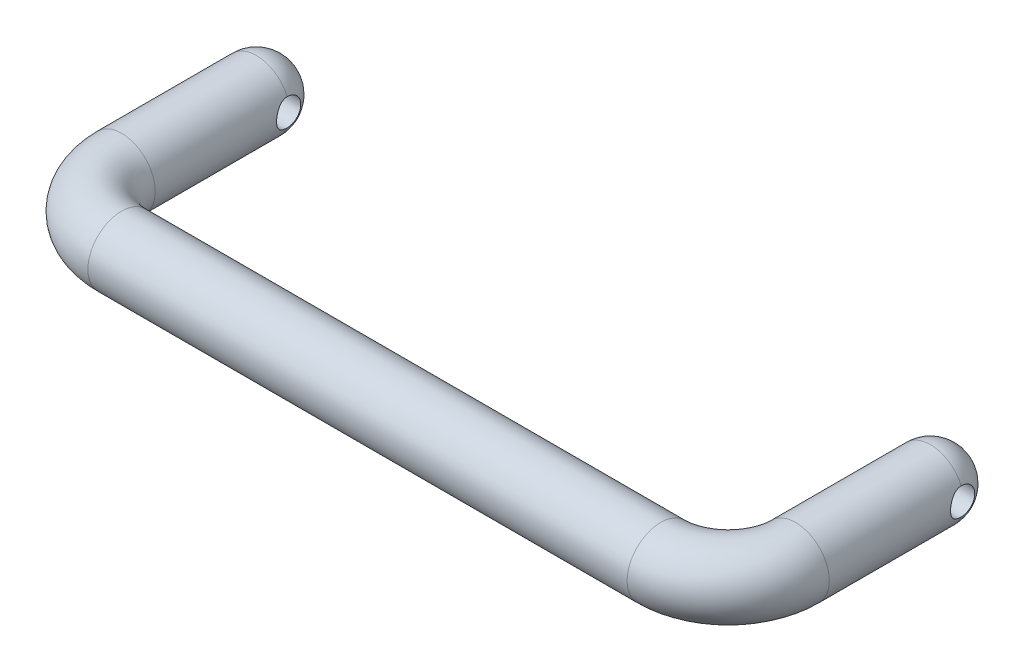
ISO-10303-21;
HEADER;
FILE_DESCRIPTION(('STEP AP214'),'2;1');
FILE_NAME('part.step','',(''),(''),'','','');
FILE_SCHEMA(('AUTOMOTIVE_DESIGN { 1 0 10303 214 1 1 1 1 }'));
ENDSEC;
DATA;
#1=APPLICATION_CONTEXT('core data for automotive mechanical design processes');
#2=APPLICATION_PROTOCOL_DEFINITION('international standard','automotive_design',2000,#1);
#3=PRODUCT_CONTEXT('',#1,'mechanical');
#4=PRODUCT('Part','Part','',(#3));
#5=PRODUCT_RELATED_PRODUCT_CATEGORY('part','',(#4));
#6=PRODUCT_DEFINITION_FORMATION('','',#4);
#7=PRODUCT_DEFINITION_CONTEXT('part definition',#1,'design');
#8=PRODUCT_DEFINITION('design','',#6,#7);
#9=PRODUCT_DEFINITION_SHAPE('','',#8);
#10=(LENGTH_UNIT() NAMED_UNIT(*) SI_UNIT(.MILLI.,.METRE.));
#11=(NAMED_UNIT(*) PLANE_ANGLE_UNIT() SI_UNIT($,.RADIAN.));
#12=(NAMED_UNIT(*) SI_UNIT($,.STERADIAN.) SOLID_ANGLE_UNIT());
#13=UNCERTAINTY_MEASURE_WITH_UNIT(LENGTH_MEASURE(1.E-05),#10,'distance_accuracy_value','');
#14=(GEOMETRIC_REPRESENTATION_CONTEXT(3) GLOBAL_UNCERTAINTY_ASSIGNED_CONTEXT((#13)) GLOBAL_UNIT_ASSIGNED_CONTEXT((#10,
#11,#12)) REPRESENTATION_CONTEXT('',''));
#15=CARTESIAN_POINT('',(0.,0.,0.));
#16=DIRECTION('',(0.,0.,1.));
#17=DIRECTION('',(1.,0.,0.));
#18=AXIS2_PLACEMENT_3D('',#15,#16,#17);
#19=CARTESIAN_POINT('',(100.,0.,20.));
#20=DIRECTION('',(0.,0.,-1.));
#21=DIRECTION('',(0.,1.,0.));
#22=AXIS2_PLACEMENT_3D('',#19,#20,#21);
#23=CYLINDRICAL_SURFACE('',#22,5.);
#24=CARTESIAN_POINT('',(104.582575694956,2.,0.));
#25=CARTESIAN_POINT('',(104.582564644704,2.00000798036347,0.0538058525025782));
#26=CARTESIAN_POINT('',(104.583523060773,1.99782891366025,0.107605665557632));
#27=CARTESIAN_POINT('',(104.587296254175,1.98915905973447,0.214771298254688));
#28=CARTESIAN_POINT('',(104.590110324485,1.98266991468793,0.268137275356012));
#29=CARTESIAN_POINT('',(104.597497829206,1.9654760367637,0.373846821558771));
#30=CARTESIAN_POINT('',(104.602064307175,1.95478796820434,0.426193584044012));
#31=CARTESIAN_POINT('',(104.612800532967,1.92931630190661,0.529700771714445));
#32=CARTESIAN_POINT('',(104.618970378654,1.91453245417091,0.580861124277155));
#33=CARTESIAN_POINT('',(104.639592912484,1.86426971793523,0.731935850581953));
#34=CARTESIAN_POINT('',(104.656174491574,1.82284489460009,0.829654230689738));
#35=CARTESIAN_POINT('',(104.693123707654,1.72548191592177,1.01679558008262));
#36=CARTESIAN_POINT('',(104.71349493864,1.66952996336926,1.10621055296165));
#37=CARTESIAN_POINT('',(104.757009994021,1.54131835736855,1.27926239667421));
#38=CARTESIAN_POINT('',(104.780242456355,1.46836913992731,1.36236721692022));
#39=CARTESIAN_POINT('',(104.826127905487,1.3096964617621,1.51554027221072));
#40=CARTESIAN_POINT('',(104.848780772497,1.22397038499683,1.58560583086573));
#41=CARTESIAN_POINT('',(104.892034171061,1.0380059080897,1.71340639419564));
#42=CARTESIAN_POINT('',(104.912518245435,0.937327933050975,1.77054480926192));
#43=CARTESIAN_POINT('',(104.94803944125,0.726824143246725,1.86684407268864));
#44=CARTESIAN_POINT('',(104.963078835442,0.617002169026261,1.90601242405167));
#45=CARTESIAN_POINT('',(104.985383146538,0.396967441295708,1.96334120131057));
#46=CARTESIAN_POINT('',(104.992989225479,0.287031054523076,1.98242695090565));
#47=CARTESIAN_POINT('',(105.000803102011,0.0652684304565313,2.00202847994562));
#48=CARTESIAN_POINT('',(105.00101352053,-0.0465571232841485,2.00255083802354));
#49=CARTESIAN_POINT('',(104.994219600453,-0.262233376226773,1.98551716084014));
#50=CARTESIAN_POINT('',(104.987619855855,-0.366179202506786,1.968974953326));
#51=CARTESIAN_POINT('',(104.968492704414,-0.569674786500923,1.92000657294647));
#52=CARTESIAN_POINT('',(104.955964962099,-0.669224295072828,1.8875795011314));
#53=CARTESIAN_POINT('',(104.925968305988,-0.862897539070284,1.80736370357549));
#54=CARTESIAN_POINT('',(104.908427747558,-0.95691685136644,1.75935075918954));
#55=CARTESIAN_POINT('',(104.87014602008,-1.13580746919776,1.64953541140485));
#56=CARTESIAN_POINT('',(104.849403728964,-1.22067554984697,1.58772817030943));
#57=CARTESIAN_POINT('',(104.805217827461,-1.38476339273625,1.4473558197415));
#58=CARTESIAN_POINT('',(104.781686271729,-1.46324770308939,1.36795752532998));
#59=CARTESIAN_POINT('',(104.735619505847,-1.60609926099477,1.19701990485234));
#60=CARTESIAN_POINT('',(104.713084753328,-1.67046007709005,1.10547507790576));
#61=CARTESIAN_POINT('',(104.67095688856,-1.78493657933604,0.909529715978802));
#62=CARTESIAN_POINT('',(104.651467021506,-1.83458932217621,0.804835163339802));
#63=CARTESIAN_POINT('',(104.618861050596,-1.91521298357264,0.587638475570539));
#64=CARTESIAN_POINT('',(104.605733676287,-1.94621696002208,0.475150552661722));
#65=CARTESIAN_POINT('',(104.592083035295,-1.9781058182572,0.30125636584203));
#66=CARTESIAN_POINT('',(104.588534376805,-1.98630505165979,0.241342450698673));
#67=CARTESIAN_POINT('',(104.583775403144,-1.99725282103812,0.120964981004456));
#68=CARTESIAN_POINT('',(104.582563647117,-2.00000471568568,0.0605017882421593));
#69=CARTESIAN_POINT('',(104.582575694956,-2.,0.));
#70=B_SPLINE_CURVE_WITH_KNOTS('',3,(#24,#25,#26,#27,#28,#29,#30,#31,#32,#33,#34,#35,#36,#37,#38,
#39,#40,#41,#42,#43,#44,#45,#46,#47,#48,#49,#50,#51,#52,#53,#54,#55,#56,#57,#58,#59,#60,#61,#62,
#63,#64,#65,#66,#67,#68,#69),.UNSPECIFIED.,.F.,.F.,(4,2,2,2,2,2,2,2,2,2,2,2,2,2,2,2,2,2,2,2,2,2,
4),(0.,0.161354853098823,0.322648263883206,0.483307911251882,0.643977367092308,
0.964683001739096,1.28569434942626,1.62318047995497,1.9607358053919,2.31162858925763,
2.66237473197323,2.9961387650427,3.32978451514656,3.64468915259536,3.95961161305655,
4.27928176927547,4.5990642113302,4.93981874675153,5.28072813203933,5.63144241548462,
5.98153315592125,6.16300192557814,6.34435877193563),.UNSPECIFIED.);
#71=CARTESIAN_POINT('',(104.582575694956,2.,0.));
#72=VERTEX_POINT('',#71);
#73=CARTESIAN_POINT('',(104.582575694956,-2.,0.));
#74=VERTEX_POINT('',#73);
#75=EDGE_CURVE('E66',#72,#74,#70,.T.);
#76=ORIENTED_EDGE('',*,*,#75,.F.);
#77=CARTESIAN_POINT('',(100.,0.,0.));
#78=DIRECTION('',(0.,0.,-1.));
#79=DIRECTION('',(0.,-1.,0.));
#80=AXIS2_PLACEMENT_3D('',#77,#78,#79);
#81=CIRCLE('',#80,5.);
#82=CARTESIAN_POINT('',(95.4174243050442,2.00000000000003,0.));
#83=VERTEX_POINT('',#82);
#84=EDGE_CURVE('E60',#83,#72,#81,.T.);
#85=ORIENTED_EDGE('',*,*,#84,.F.);
#86=CARTESIAN_POINT('',(95.4174243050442,-2.,0.));
#87=CARTESIAN_POINT('',(95.4174353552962,-2.00000798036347,0.0538058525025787));
#88=CARTESIAN_POINT('',(95.4164769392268,-1.99782891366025,0.107605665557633));
#89=CARTESIAN_POINT('',(95.4127037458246,-1.98915905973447,0.214771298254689));
#90=CARTESIAN_POINT('',(95.4098896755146,-1.98266991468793,0.268137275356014));
#91=CARTESIAN_POINT('',(95.4025021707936,-1.9654760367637,0.373846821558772));
#92=CARTESIAN_POINT('',(95.3979356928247,-1.95478796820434,0.426193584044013));
#93=CARTESIAN_POINT('',(95.3871994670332,-1.92931630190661,0.529700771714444));
#94=CARTESIAN_POINT('',(95.381029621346,-1.91453245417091,0.580861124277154));
#95=CARTESIAN_POINT('',(95.3604070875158,-1.86426971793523,0.731935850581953));
#96=CARTESIAN_POINT('',(95.3438255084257,-1.82284489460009,0.829654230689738));
#97=CARTESIAN_POINT('',(95.3068762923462,-1.72548191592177,1.01679558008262));
#98=CARTESIAN_POINT('',(95.2865050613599,-1.66952996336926,1.10621055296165));
#99=CARTESIAN_POINT('',(95.2429900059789,-1.54131835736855,1.27926239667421));
#100=CARTESIAN_POINT('',(95.2197575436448,-1.46836913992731,1.36236721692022));
#101=CARTESIAN_POINT('',(95.1738720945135,-1.3096964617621,1.51554027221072));
#102=CARTESIAN_POINT('',(95.1512192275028,-1.22397038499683,1.58560583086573));
#103=CARTESIAN_POINT('',(95.1079658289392,-1.0380059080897,1.71340639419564));
#104=CARTESIAN_POINT('',(95.0874817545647,-0.937327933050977,1.77054480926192));
#105=CARTESIAN_POINT('',(95.05196055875,-0.726824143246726,1.86684407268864));
#106=CARTESIAN_POINT('',(95.0369211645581,-0.617002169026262,1.90601242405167));
#107=CARTESIAN_POINT('',(95.0146168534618,-0.396967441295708,1.96334120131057));
#108=CARTESIAN_POINT('',(95.0070107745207,-0.287031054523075,1.98242695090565));
#109=CARTESIAN_POINT('',(94.9991968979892,-0.065268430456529,2.00202847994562));
#110=CARTESIAN_POINT('',(94.9989864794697,0.046557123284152,2.00255083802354));
#111=CARTESIAN_POINT('',(95.0057803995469,0.262233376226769,1.98551716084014));
#112=CARTESIAN_POINT('',(95.0123801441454,0.366179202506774,1.968974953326));
#113=CARTESIAN_POINT('',(95.0315072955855,0.569674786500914,1.92000657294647));
#114=CARTESIAN_POINT('',(95.0440350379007,0.66922429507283,1.8875795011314));
#115=CARTESIAN_POINT('',(95.0740316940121,0.862897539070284,1.8073637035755));
#116=CARTESIAN_POINT('',(95.0915722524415,0.956916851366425,1.75935075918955));
#117=CARTESIAN_POINT('',(95.1298539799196,1.13580746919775,1.64953541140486));
#118=CARTESIAN_POINT('',(95.1505962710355,1.22067554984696,1.58772817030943));
#119=CARTESIAN_POINT('',(95.1947821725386,1.38476339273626,1.44735581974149));
#120=CARTESIAN_POINT('',(95.2183137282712,1.46324770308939,1.36795752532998));
#121=CARTESIAN_POINT('',(95.2643804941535,1.60609926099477,1.19701990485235));
#122=CARTESIAN_POINT('',(95.2869152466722,1.67046007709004,1.10547507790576));
#123=CARTESIAN_POINT('',(95.3290431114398,1.78493657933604,0.909529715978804));
#124=CARTESIAN_POINT('',(95.3485329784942,1.83458932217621,0.804835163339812));
#125=CARTESIAN_POINT('',(95.3811389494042,1.91521298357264,0.587638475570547));
#126=CARTESIAN_POINT('',(95.3942663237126,1.94621696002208,0.475150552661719));
#127=CARTESIAN_POINT('',(95.407916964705,1.9781058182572,0.301256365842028));
#128=CARTESIAN_POINT('',(95.4114656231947,1.98630505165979,0.241342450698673));
#129=CARTESIAN_POINT('',(95.4162245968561,1.99725282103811,0.12096498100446));
#130=CARTESIAN_POINT('',(95.4174363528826,2.00000471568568,0.060501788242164));
#131=CARTESIAN_POINT('',(95.4174243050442,2.,0.));
#132=B_SPLINE_CURVE_WITH_KNOTS('',3,(#86,#87,#88,#89,#90,#91,#92,#93,#94,#95,#96,#97,#98,#99,
#100,#101,#102,#103,#104,#105,#106,#107,#108,#109,#110,#111,#112,#113,#114,#115,#116,#117,#118,
#119,#120,#121,#122,#123,#124,#125,#126,#127,#128,#129,#130,#131),.UNSPECIFIED.,.F.,.F.,(4,2,2,
2,2,2,2,2,2,2,2,2,2,2,2,2,2,2,2,2,2,2,4),(0.,0.161354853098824,0.322648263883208,
0.483307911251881,0.643977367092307,0.964683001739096,1.28569434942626,1.62318047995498,
1.9607358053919,2.31162858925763,2.66237473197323,2.9961387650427,3.32978451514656,
3.64468915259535,3.95961161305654,4.27928176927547,4.59906421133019,4.93981874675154,
5.28072813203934,5.63144241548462,5.98153315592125,6.16300192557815,6.34435877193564),.UNSPECIFIED.);
#133=CARTESIAN_POINT('',(95.4174243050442,-2.00000000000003,0.));
#134=VERTEX_POINT('',#133);
#135=EDGE_CURVE('E55',#134,#83,#132,.T.);
#136=ORIENTED_EDGE('',*,*,#135,.F.);
#137=EDGE_CURVE('E65',#74,#134,#81,.T.);
#138=ORIENTED_EDGE('',*,*,#137,.F.);
#139=EDGE_LOOP('',(#76,#85,#136,#138));
#140=FACE_BOUND('',#139,.T.);
#141=CARTESIAN_POINT('',(100.,0.,20.));
#142=DIRECTION('',(0.,0.,-1.));
#143=DIRECTION('',(0.,-1.,0.));
#144=AXIS2_PLACEMENT_3D('',#141,#142,#143);
#145=CIRCLE('',#144,5.);
#146=CARTESIAN_POINT('',(105.,0.,20.));
#147=VERTEX_POINT('',#146);
#148=EDGE_CURVE('E70',#147,#147,#145,.T.);
#149=ORIENTED_EDGE('',*,*,#148,.T.);
#150=EDGE_LOOP('',(#149));
#151=FACE_BOUND('',#150,.T.);
#152=ADVANCED_FACE('F14',(#140,#151),#23,.T.);
#153=CARTESIAN_POINT('',(90.,0.,20.));
#154=DIRECTION('',(0.,1.,0.));
#155=DIRECTION('',(-1.,0.,0.));
#156=AXIS2_PLACEMENT_3D('',#153,#154,#155);
#157=TOROIDAL_SURFACE('',#156,10.,5.);
#158=CARTESIAN_POINT('',(90.,0.,30.));
#159=DIRECTION('',(1.,0.,0.));
#160=DIRECTION('',(0.,-1.,0.));
#161=AXIS2_PLACEMENT_3D('',#158,#159,#160);
#162=CIRCLE('',#161,5.);
#163=CARTESIAN_POINT('',(90.,0.,35.));
#164=VERTEX_POINT('',#163);
#165=EDGE_CURVE('E73',#164,#164,#162,.T.);
#166=CARTESIAN_POINT('',(90.,0.,20.));
#167=DIRECTION('',(0.,1.,0.));
#168=DIRECTION('',(-1.,0.,0.));
#169=AXIS2_PLACEMENT_3D('',#166,#167,#168);
#170=CIRCLE('',#169,15.);
#171=EDGE_CURVE('',#164,#147,#170,.T.);
#172=ORIENTED_EDGE('',*,*,#165,.T.);
#173=ORIENTED_EDGE('',*,*,#148,.F.);
#174=ORIENTED_EDGE('',*,*,#171,.T.);
#175=ORIENTED_EDGE('',*,*,#171,.F.);
#176=EDGE_LOOP('',(#172,#174,#173,#175));
#177=FACE_BOUND('',#176,.T.);
#178=ADVANCED_FACE('F143',(#177),#157,.T.);
#179=CARTESIAN_POINT('',(10.,0.,30.));
#180=DIRECTION('',(1.,0.,0.));
#181=DIRECTION('',(0.,1.,0.));
#182=AXIS2_PLACEMENT_3D('',#179,#180,#181);
#183=CYLINDRICAL_SURFACE('',#182,5.);
#184=CARTESIAN_POINT('',(10.,0.,30.));
#185=DIRECTION('',(1.,0.,0.));
#186=DIRECTION('',(0.,-1.,0.));
#187=AXIS2_PLACEMENT_3D('',#184,#185,#186);
#188=CIRCLE('',#187,5.);
#189=CARTESIAN_POINT('',(10.,0.,35.));
#190=VERTEX_POINT('',#189);
#191=EDGE_CURVE('E78',#190,#190,#188,.T.);
#192=ORIENTED_EDGE('',*,*,#191,.T.);
#193=EDGE_LOOP('',(#192));
#194=FACE_BOUND('',#193,.T.);
#195=ORIENTED_EDGE('',*,*,#165,.F.);
#196=EDGE_LOOP('',(#195));
#197=FACE_BOUND('',#196,.T.);
#198=ADVANCED_FACE('F139',(#194,#197),#183,.T.);
#199=CARTESIAN_POINT('',(10.,0.,20.));
#200=DIRECTION('',(0.,1.,0.));
#201=DIRECTION('',(-1.,0.,0.));
#202=AXIS2_PLACEMENT_3D('',#199,#200,#201);
#203=TOROIDAL_SURFACE('',#202,10.,5.);
#204=CARTESIAN_POINT('',(0.,0.,20.));
#205=DIRECTION('',(0.,0.,1.));
#206=DIRECTION('',(0.,-1.,0.));
#207=AXIS2_PLACEMENT_3D('',#204,#205,#206);
#208=CIRCLE('',#207,5.);
#209=CARTESIAN_POINT('',(-5.,0.,20.));
#210=VERTEX_POINT('',#209);
#211=EDGE_CURVE('E81',#210,#210,#208,.T.);
#212=CARTESIAN_POINT('',(10.,0.,20.));
#213=DIRECTION('',(0.,1.,0.));
#214=DIRECTION('',(-1.,0.,0.));
#215=AXIS2_PLACEMENT_3D('',#212,#213,#214);
#216=CIRCLE('',#215,15.);
#217=EDGE_CURVE('',#210,#190,#216,.T.);
#218=ORIENTED_EDGE('',*,*,#211,.T.);
#219=ORIENTED_EDGE('',*,*,#191,.F.);
#220=ORIENTED_EDGE('',*,*,#217,.T.);
#221=ORIENTED_EDGE('',*,*,#217,.F.);
#222=EDGE_LOOP('',(#218,#220,#219,#221));
#223=FACE_BOUND('',#222,.T.);
#224=ADVANCED_FACE('F131',(#223),#203,.T.);
#225=CARTESIAN_POINT('',(0.,0.,20.));
#226=DIRECTION('',(0.,0.,-1.));
#227=DIRECTION('',(0.,1.,0.));
#228=AXIS2_PLACEMENT_3D('',#225,#226,#227);
#229=CYLINDRICAL_SURFACE('',#228,5.);
#230=ORIENTED_EDGE('',*,*,#211,.F.);
#231=EDGE_LOOP('',(#230));
#232=FACE_BOUND('',#231,.T.);
#233=CARTESIAN_POINT('',(0.,0.,0.));
#234=DIRECTION('',(0.,0.,-1.));
#235=DIRECTION('',(0.,1.,0.));
#236=AXIS2_PLACEMENT_3D('',#233,#234,#235);
#237=CIRCLE('',#236,5.);
#238=CARTESIAN_POINT('',(-4.5825756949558,2.,0.));
#239=VERTEX_POINT('',#238);
#240=CARTESIAN_POINT('',(4.5825756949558,2.,0.));
#241=VERTEX_POINT('',#240);
#242=EDGE_CURVE('E85',#239,#241,#237,.T.);
#243=ORIENTED_EDGE('',*,*,#242,.F.);
#244=CARTESIAN_POINT('',(-4.5825756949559,2.,0.));
#245=CARTESIAN_POINT('',(-4.58256464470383,2.00000798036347,0.0538058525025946));
#246=CARTESIAN_POINT('',(-4.58352306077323,1.99782891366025,0.10760566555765));
#247=CARTESIAN_POINT('',(-4.58729625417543,1.98915905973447,0.214771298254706));
#248=CARTESIAN_POINT('',(-4.59011032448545,1.98266991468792,0.26813727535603));
#249=CARTESIAN_POINT('',(-4.59749782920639,1.9654760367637,0.373846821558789));
#250=CARTESIAN_POINT('',(-4.60206430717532,1.95478796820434,0.426193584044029));
#251=CARTESIAN_POINT('',(-4.61280053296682,1.9293163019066,0.52970077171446));
#252=CARTESIAN_POINT('',(-4.61897037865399,1.9145324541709,0.580861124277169));
#253=CARTESIAN_POINT('',(-4.63959291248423,1.86426971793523,0.731935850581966));
#254=CARTESIAN_POINT('',(-4.65617449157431,1.82284489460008,0.82965423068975));
#255=CARTESIAN_POINT('',(-4.69312370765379,1.72548191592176,1.01679558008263));
#256=CARTESIAN_POINT('',(-4.71349493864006,1.66952996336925,1.10621055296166));
#257=CARTESIAN_POINT('',(-4.75700999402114,1.54131835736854,1.27926239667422));
#258=CARTESIAN_POINT('',(-4.78024245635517,1.4683691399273,1.36236721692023));
#259=CARTESIAN_POINT('',(-4.82612790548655,1.30969646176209,1.51554027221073));
#260=CARTESIAN_POINT('',(-4.84878077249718,1.22397038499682,1.58560583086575));
#261=CARTESIAN_POINT('',(-4.89203417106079,1.03800590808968,1.71340639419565));
#262=CARTESIAN_POINT('',(-4.91251824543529,0.937327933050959,1.77054480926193));
#263=CARTESIAN_POINT('',(-4.94803944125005,0.726824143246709,1.86684407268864));
#264=CARTESIAN_POINT('',(-4.96307883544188,0.617002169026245,1.90601242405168));
#265=CARTESIAN_POINT('',(-4.98538314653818,0.396967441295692,1.96334120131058));
#266=CARTESIAN_POINT('',(-4.99298922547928,0.287031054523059,1.98242695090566));
#267=CARTESIAN_POINT('',(-5.00080310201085,0.065268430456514,2.00202847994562));
#268=CARTESIAN_POINT('',(-5.0010135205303,-0.0465571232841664,2.00255083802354));
#269=CARTESIAN_POINT('',(-4.99421960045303,-0.262233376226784,1.98551716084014));
#270=CARTESIAN_POINT('',(-4.98761985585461,-0.36617920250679,1.968974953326));
#271=CARTESIAN_POINT('',(-4.96849270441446,-0.569674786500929,1.92000657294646));
#272=CARTESIAN_POINT('',(-4.95596496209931,-0.669224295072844,1.88757950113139));
#273=CARTESIAN_POINT('',(-4.92596830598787,-0.862897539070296,1.80736370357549));
#274=CARTESIAN_POINT('',(-4.90842774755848,-0.956916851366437,1.75935075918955));
#275=CARTESIAN_POINT('',(-4.87014602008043,-1.13580746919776,1.64953541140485));
#276=CARTESIAN_POINT('',(-4.8494037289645,-1.22067554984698,1.58772817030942));
#277=CARTESIAN_POINT('',(-4.80521782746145,-1.38476339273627,1.44735581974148));
#278=CARTESIAN_POINT('',(-4.78168627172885,-1.4632477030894,1.36795752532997));
#279=CARTESIAN_POINT('',(-4.73561950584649,-1.60609926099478,1.19701990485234));
#280=CARTESIAN_POINT('',(-4.71308475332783,-1.67046007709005,1.10547507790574));
#281=CARTESIAN_POINT('',(-4.67095688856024,-1.78493657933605,0.909529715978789));
#282=CARTESIAN_POINT('',(-4.65146702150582,-1.83458932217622,0.804835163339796));
#283=CARTESIAN_POINT('',(-4.61886105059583,-1.91521298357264,0.58763847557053));
#284=CARTESIAN_POINT('',(-4.60573367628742,-1.94621696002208,0.475150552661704));
#285=CARTESIAN_POINT('',(-4.59208303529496,-1.9781058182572,0.301256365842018));
#286=CARTESIAN_POINT('',(-4.58853437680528,-1.98630505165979,0.241342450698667));
#287=CARTESIAN_POINT('',(-4.58377540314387,-1.99725282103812,0.120964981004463));
#288=CARTESIAN_POINT('',(-4.58256364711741,-2.00000471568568,0.0605017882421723));
#289=CARTESIAN_POINT('',(-4.5825756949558,-2.,0.));
#290=B_SPLINE_CURVE_WITH_KNOTS('',3,(#244,#245,#246,#247,#248,#249,#250,#251,#252,#253,#254,
#255,#256,#257,#258,#259,#260,#261,#262,#263,#264,#265,#266,#267,#268,#269,#270,#271,#272,#273,
#274,#275,#276,#277,#278,#279,#280,#281,#282,#283,#284,#285,#286,#287,#288,#289),.UNSPECIFIED.,
.F.,.F.,(4,2,2,2,2,2,2,2,2,2,2,2,2,2,2,2,2,2,2,2,2,2,4),(0.,0.161354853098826,0.32264826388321,
0.483307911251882,0.643977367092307,0.964683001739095,1.28569434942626,1.62318047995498,
1.96073580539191,2.31162858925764,2.66237473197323,2.9961387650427,3.32978451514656,
3.64468915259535,3.95961161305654,4.27928176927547,4.59906421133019,4.93981874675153,
5.28072813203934,5.63144241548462,5.98153315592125,6.16300192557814,6.34435877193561),.UNSPECIFIED.);
#291=CARTESIAN_POINT('',(-4.5825756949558,-2.,0.));
#292=VERTEX_POINT('',#291);
#293=EDGE_CURVE('E28',#239,#292,#290,.T.);
#294=ORIENTED_EDGE('',*,*,#293,.T.);
#295=CARTESIAN_POINT('',(4.5825756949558,-2.,0.));
#296=VERTEX_POINT('',#295);
#297=EDGE_CURVE('E84',#296,#292,#237,.T.);
#298=ORIENTED_EDGE('',*,*,#297,.F.);
#299=CARTESIAN_POINT('',(4.5825756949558,-2.,0.));
#300=CARTESIAN_POINT('',(4.5825646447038,-2.00000798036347,0.053805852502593));
#301=CARTESIAN_POINT('',(4.58352306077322,-1.99782891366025,0.107605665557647));
#302=CARTESIAN_POINT('',(4.58729625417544,-1.98915905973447,0.214771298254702));
#303=CARTESIAN_POINT('',(4.59011032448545,-1.98266991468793,0.268137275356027));
#304=CARTESIAN_POINT('',(4.59749782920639,-1.9654760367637,0.373846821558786));
#305=CARTESIAN_POINT('',(4.60206430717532,-1.95478796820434,0.426193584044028));
#306=CARTESIAN_POINT('',(4.61280053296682,-1.9293163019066,0.529700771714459));
#307=CARTESIAN_POINT('',(4.61897037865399,-1.9145324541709,0.580861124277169));
#308=CARTESIAN_POINT('',(4.63959291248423,-1.86426971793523,0.731935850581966));
#309=CARTESIAN_POINT('',(4.65617449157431,-1.82284489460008,0.829654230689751));
#310=CARTESIAN_POINT('',(4.69312370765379,-1.72548191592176,1.01679558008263));
#311=CARTESIAN_POINT('',(4.71349493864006,-1.66952996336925,1.10621055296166));
#312=CARTESIAN_POINT('',(4.75700999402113,-1.54131835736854,1.27926239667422));
#313=CARTESIAN_POINT('',(4.78024245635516,-1.4683691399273,1.36236721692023));
#314=CARTESIAN_POINT('',(4.82612790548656,-1.30969646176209,1.51554027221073));
#315=CARTESIAN_POINT('',(4.8487807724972,-1.22397038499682,1.58560583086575));
#316=CARTESIAN_POINT('',(4.89203417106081,-1.03800590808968,1.71340639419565));
#317=CARTESIAN_POINT('',(4.9125182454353,-0.937327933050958,1.77054480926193));
#318=CARTESIAN_POINT('',(4.94803944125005,-0.726824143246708,1.86684407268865));
#319=CARTESIAN_POINT('',(4.96307883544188,-0.617002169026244,1.90601242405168));
#320=CARTESIAN_POINT('',(4.98538314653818,-0.396967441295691,1.96334120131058));
#321=CARTESIAN_POINT('',(4.99298922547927,-0.287031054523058,1.98242695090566));
#322=CARTESIAN_POINT('',(5.00080310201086,-0.0652684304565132,2.00202847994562));
#323=CARTESIAN_POINT('',(5.00101352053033,0.046557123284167,2.00255083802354));
#324=CARTESIAN_POINT('',(4.99421960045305,0.262233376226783,1.98551716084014));
#325=CARTESIAN_POINT('',(4.98761985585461,0.366179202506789,1.968974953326));
#326=CARTESIAN_POINT('',(4.96849270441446,0.569674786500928,1.92000657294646));
#327=CARTESIAN_POINT('',(4.95596496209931,0.669224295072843,1.88757950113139));
#328=CARTESIAN_POINT('',(4.92596830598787,0.862897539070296,1.80736370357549));
#329=CARTESIAN_POINT('',(4.90842774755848,0.956916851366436,1.75935075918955));
#330=CARTESIAN_POINT('',(4.87014602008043,1.13580746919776,1.64953541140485));
#331=CARTESIAN_POINT('',(4.84940372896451,1.22067554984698,1.58772817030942));
#332=CARTESIAN_POINT('',(4.80521782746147,1.38476339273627,1.44735581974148));
#333=CARTESIAN_POINT('',(4.78168627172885,1.4632477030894,1.36795752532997));
#334=CARTESIAN_POINT('',(4.73561950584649,1.60609926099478,1.19701990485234));
#335=CARTESIAN_POINT('',(4.71308475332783,1.67046007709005,1.10547507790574));
#336=CARTESIAN_POINT('',(4.67095688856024,1.78493657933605,0.909529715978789));
#337=CARTESIAN_POINT('',(4.65146702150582,1.83458932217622,0.804835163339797));
#338=CARTESIAN_POINT('',(4.61886105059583,1.91521298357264,0.587638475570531));
#339=CARTESIAN_POINT('',(4.60573367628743,1.94621696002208,0.475150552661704));
#340=CARTESIAN_POINT('',(4.59208303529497,1.9781058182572,0.301256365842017));
#341=CARTESIAN_POINT('',(4.58853437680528,1.98630505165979,0.241342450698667));
#342=CARTESIAN_POINT('',(4.58377540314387,1.99725282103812,0.120964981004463));
#343=CARTESIAN_POINT('',(4.58256364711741,2.00000471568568,0.0605017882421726));
#344=CARTESIAN_POINT('',(4.5825756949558,2.,0.));
#345=B_SPLINE_CURVE_WITH_KNOTS('',3,(#299,#300,#301,#302,#303,#304,#305,#306,#307,#308,#309,
#310,#311,#312,#313,#314,#315,#316,#317,#318,#319,#320,#321,#322,#323,#324,#325,#326,#327,#328,
#329,#330,#331,#332,#333,#334,#335,#336,#337,#338,#339,#340,#341,#342,#343,#344),.UNSPECIFIED.,
.F.,.F.,(4,2,2,2,2,2,2,2,2,2,2,2,2,2,2,2,2,2,2,2,2,2,4),(0.,0.161354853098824,0.322648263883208,
0.483307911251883,0.643977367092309,0.964683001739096,1.28569434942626,1.62318047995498,
1.96073580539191,2.31162858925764,2.66237473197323,2.9961387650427,3.32978451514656,
3.64468915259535,3.95961161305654,4.27928176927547,4.59906421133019,4.93981874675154,
5.28072813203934,5.63144241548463,5.98153315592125,6.16300192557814,6.34435877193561),.UNSPECIFIED.);
#346=EDGE_CURVE('E35',#296,#241,#345,.T.);
#347=ORIENTED_EDGE('',*,*,#346,.T.);
#348=EDGE_LOOP('',(#243,#294,#298,#347));
#349=FACE_BOUND('',#348,.T.);
#350=ADVANCED_FACE('F97',(#232,#349),#229,.T.);
#351=CARTESIAN_POINT('',(0.,0.,0.));
#352=DIRECTION('',(-1.,0.,0.));
#353=DIRECTION('',(0.,-1.,0.));
#354=AXIS2_PLACEMENT_3D('',#351,#352,#353);
#355=SPHERICAL_SURFACE('',#354,5.);
#356=CARTESIAN_POINT('',(4.5825756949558,0.,0.));
#357=DIRECTION('',(-1.,0.,0.));
#358=DIRECTION('',(0.,-1.,0.));
#359=AXIS2_PLACEMENT_3D('',#356,#357,#358);
#360=CIRCLE('',#359,2.);
#361=EDGE_CURVE('E95',#296,#241,#360,.F.);
#362=ORIENTED_EDGE('',*,*,#361,.F.);
#363=ORIENTED_EDGE('',*,*,#297,.T.);
#364=CARTESIAN_POINT('',(-4.5825756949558,0.,0.));
#365=DIRECTION('',(1.,0.,0.));
#366=DIRECTION('',(0.,1.,0.));
#367=AXIS2_PLACEMENT_3D('',#364,#365,#366);
#368=CIRCLE('',#367,2.);
#369=EDGE_CURVE('E123',#239,#292,#368,.F.);
#370=ORIENTED_EDGE('',*,*,#369,.F.);
#371=ORIENTED_EDGE('',*,*,#242,.T.);
#372=EDGE_LOOP('',(#362,#363,#370,#371));
#373=FACE_BOUND('',#372,.T.);
#374=ADVANCED_FACE('F128',(#373),#355,.T.);
#375=CARTESIAN_POINT('',(100.,0.,0.));
#376=DIRECTION('',(1.,0.,0.));
#377=DIRECTION('',(0.,-1.,0.));
#378=AXIS2_PLACEMENT_3D('',#375,#376,#377);
#379=SPHERICAL_SURFACE('',#378,5.);
#380=CARTESIAN_POINT('',(104.582575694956,0.,0.));
#381=DIRECTION('',(-1.,0.,0.));
#382=DIRECTION('',(0.,-1.,0.));
#383=AXIS2_PLACEMENT_3D('',#380,#381,#382);
#384=CIRCLE('',#383,2.);
#385=EDGE_CURVE('E9',#74,#72,#384,.F.);
#386=ORIENTED_EDGE('',*,*,#385,.F.);
#387=ORIENTED_EDGE('',*,*,#137,.T.);
#388=CARTESIAN_POINT('',(95.4174243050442,0.,0.));
#389=DIRECTION('',(1.,0.,0.));
#390=DIRECTION('',(0.,1.,0.));
#391=AXIS2_PLACEMENT_3D('',#388,#389,#390);
#392=CIRCLE('',#391,2.);
#393=EDGE_CURVE('E22',#83,#134,#392,.F.);
#394=ORIENTED_EDGE('',*,*,#393,.F.);
#395=ORIENTED_EDGE('',*,*,#84,.T.);
#396=EDGE_LOOP('',(#386,#387,#394,#395));
#397=FACE_BOUND('',#396,.T.);
#398=ADVANCED_FACE('F69',(#397),#379,.T.);
#399=CARTESIAN_POINT('',(-5.,0.,0.));
#400=DIRECTION('',(1.,0.,0.));
#401=DIRECTION('',(0.,1.,0.));
#402=AXIS2_PLACEMENT_3D('',#399,#400,#401);
#403=CYLINDRICAL_SURFACE('',#402,2.);
#404=ORIENTED_EDGE('',*,*,#75,.T.);
#405=ORIENTED_EDGE('',*,*,#385,.T.);
#406=EDGE_LOOP('',(#404,#405));
#407=FACE_BOUND('',#406,.T.);
#408=ORIENTED_EDGE('',*,*,#135,.T.);
#409=ORIENTED_EDGE('',*,*,#393,.T.);
#410=EDGE_LOOP('',(#408,#409));
#411=FACE_BOUND('',#410,.T.);
#412=ADVANCED_FACE('F54',(#407,#411),#403,.F.);
#413=ORIENTED_EDGE('',*,*,#369,.T.);
#414=ORIENTED_EDGE('',*,*,#293,.F.);
#415=EDGE_LOOP('',(#413,#414));
#416=FACE_BOUND('',#415,.T.);
#417=ORIENTED_EDGE('',*,*,#361,.T.);
#418=ORIENTED_EDGE('',*,*,#346,.F.);
#419=EDGE_LOOP('',(#417,#418));
#420=FACE_BOUND('',#419,.T.);
#421=ADVANCED_FACE('F104',(#416,#420),#403,.F.);
#422=CLOSED_SHELL('',(#152,#178,#198,#224,#350,#374,#398,#412,#421));
#423=MANIFOLD_SOLID_BREP('B1',#422);
#424=ADVANCED_BREP_SHAPE_REPRESENTATION('',(#18,#423),#14);
#425=SHAPE_DEFINITION_REPRESENTATION(#9,#424);
ENDSEC;
END-ISO-10303-21;
